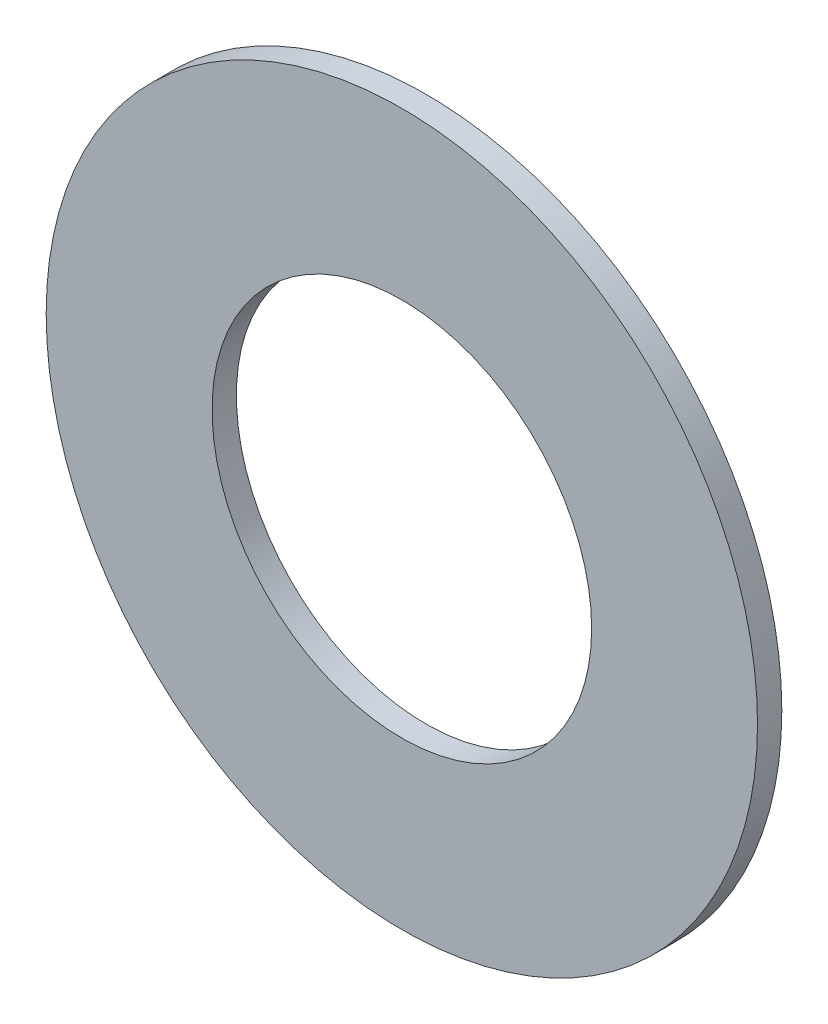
ISO-10303-21;
HEADER;
FILE_DESCRIPTION(('STEP AP214'),'2;1');
FILE_NAME('part.step','',(''),(''),'','','');
FILE_SCHEMA(('AUTOMOTIVE_DESIGN { 1 0 10303 214 1 1 1 1 }'));
ENDSEC;
DATA;
#1=APPLICATION_CONTEXT('core data for automotive mechanical design processes');
#2=APPLICATION_PROTOCOL_DEFINITION('international standard','automotive_design',2000,#1);
#3=PRODUCT_CONTEXT('',#1,'mechanical');
#4=PRODUCT('Part','Part','',(#3));
#5=PRODUCT_RELATED_PRODUCT_CATEGORY('part','',(#4));
#6=PRODUCT_DEFINITION_FORMATION('','',#4);
#7=PRODUCT_DEFINITION_CONTEXT('part definition',#1,'design');
#8=PRODUCT_DEFINITION('design','',#6,#7);
#9=PRODUCT_DEFINITION_SHAPE('','',#8);
#10=(LENGTH_UNIT() NAMED_UNIT(*) SI_UNIT(.MILLI.,.METRE.));
#11=(NAMED_UNIT(*) PLANE_ANGLE_UNIT() SI_UNIT($,.RADIAN.));
#12=(NAMED_UNIT(*) SI_UNIT($,.STERADIAN.) SOLID_ANGLE_UNIT());
#13=UNCERTAINTY_MEASURE_WITH_UNIT(LENGTH_MEASURE(1.E-05),#10,'distance_accuracy_value','');
#14=(GEOMETRIC_REPRESENTATION_CONTEXT(3) GLOBAL_UNCERTAINTY_ASSIGNED_CONTEXT((#13)) GLOBAL_UNIT_ASSIGNED_CONTEXT((#10,
#11,#12)) REPRESENTATION_CONTEXT('',''));
#15=CARTESIAN_POINT('',(0.,0.,0.));
#16=DIRECTION('',(0.,0.,1.));
#17=DIRECTION('',(1.,0.,0.));
#18=AXIS2_PLACEMENT_3D('',#15,#16,#17);
#19=CARTESIAN_POINT('',(0.,0.,0.8128));
#20=DIRECTION('',(0.,0.,1.));
#21=DIRECTION('',(1.,0.,0.));
#22=AXIS2_PLACEMENT_3D('',#19,#20,#21);
#23=PLANE('',#22);
#24=CARTESIAN_POINT('',(0.,0.,0.8128));
#25=DIRECTION('',(0.,0.,1.));
#26=DIRECTION('',(1.,0.,0.));
#27=AXIS2_PLACEMENT_3D('',#24,#25,#26);
#28=CIRCLE('',#27,11.8999);
#29=CARTESIAN_POINT('',(11.8999,0.,0.8128));
#30=VERTEX_POINT('',#29);
#31=EDGE_CURVE('E10',#30,#30,#28,.T.);
#32=ORIENTED_EDGE('',*,*,#31,.T.);
#33=EDGE_LOOP('',(#32));
#34=FACE_BOUND('',#33,.T.);
#35=CARTESIAN_POINT('',(0.,0.,0.8128));
#36=DIRECTION('',(0.,0.,1.));
#37=DIRECTION('',(1.,0.,0.));
#38=AXIS2_PLACEMENT_3D('',#35,#36,#37);
#39=CIRCLE('',#38,6.35);
#40=CARTESIAN_POINT('',(6.35,0.,0.8128));
#41=VERTEX_POINT('',#40);
#42=EDGE_CURVE('E41',#41,#41,#39,.T.);
#43=ORIENTED_EDGE('',*,*,#42,.F.);
#44=EDGE_LOOP('',(#43));
#45=FACE_BOUND('',#44,.T.);
#46=ADVANCED_FACE('F30',(#34,#45),#23,.T.);
#47=CARTESIAN_POINT('',(0.,0.,0.));
#48=DIRECTION('',(0.,0.,1.));
#49=DIRECTION('',(1.,0.,0.));
#50=AXIS2_PLACEMENT_3D('',#47,#48,#49);
#51=PLANE('',#50);
#52=CARTESIAN_POINT('',(0.,0.,0.));
#53=DIRECTION('',(0.,0.,1.));
#54=DIRECTION('',(1.,0.,0.));
#55=AXIS2_PLACEMENT_3D('',#52,#53,#54);
#56=CIRCLE('',#55,11.8999);
#57=CARTESIAN_POINT('',(11.8999,0.,0.));
#58=VERTEX_POINT('',#57);
#59=EDGE_CURVE('E34',#58,#58,#56,.T.);
#60=ORIENTED_EDGE('',*,*,#59,.F.);
#61=EDGE_LOOP('',(#60));
#62=FACE_BOUND('',#61,.T.);
#63=CARTESIAN_POINT('',(0.,0.,0.));
#64=DIRECTION('',(0.,0.,1.));
#65=DIRECTION('',(1.,0.,0.));
#66=AXIS2_PLACEMENT_3D('',#63,#64,#65);
#67=CIRCLE('',#66,6.35);
#68=CARTESIAN_POINT('',(6.35,0.,0.));
#69=VERTEX_POINT('',#68);
#70=EDGE_CURVE('E43',#69,#69,#67,.T.);
#71=ORIENTED_EDGE('',*,*,#70,.T.);
#72=EDGE_LOOP('',(#71));
#73=FACE_BOUND('',#72,.T.);
#74=ADVANCED_FACE('F53',(#62,#73),#51,.F.);
#75=CARTESIAN_POINT('',(0.,0.,0.8128));
#76=DIRECTION('',(0.,0.,-1.));
#77=DIRECTION('',(-1.,0.,0.));
#78=AXIS2_PLACEMENT_3D('',#75,#76,#77);
#79=CYLINDRICAL_SURFACE('',#78,11.8999);
#80=ORIENTED_EDGE('',*,*,#31,.F.);
#81=EDGE_LOOP('',(#80));
#82=FACE_BOUND('',#81,.T.);
#83=ORIENTED_EDGE('',*,*,#59,.T.);
#84=EDGE_LOOP('',(#83));
#85=FACE_BOUND('',#84,.T.);
#86=ADVANCED_FACE('F32',(#82,#85),#79,.T.);
#87=CARTESIAN_POINT('',(0.,0.,0.8128));
#88=DIRECTION('',(0.,0.,-1.));
#89=DIRECTION('',(-1.,0.,0.));
#90=AXIS2_PLACEMENT_3D('',#87,#88,#89);
#91=CYLINDRICAL_SURFACE('',#90,6.35);
#92=ORIENTED_EDGE('',*,*,#42,.T.);
#93=EDGE_LOOP('',(#92));
#94=FACE_BOUND('',#93,.T.);
#95=ORIENTED_EDGE('',*,*,#70,.F.);
#96=EDGE_LOOP('',(#95));
#97=FACE_BOUND('',#96,.T.);
#98=ADVANCED_FACE('F49',(#94,#97),#91,.F.);
#99=CLOSED_SHELL('',(#46,#74,#86,#98));
#100=MANIFOLD_SOLID_BREP('B2',#99);
#101=ADVANCED_BREP_SHAPE_REPRESENTATION('',(#18,#100),#14);
#102=SHAPE_DEFINITION_REPRESENTATION(#9,#101);
ENDSEC;
END-ISO-10303-21;
